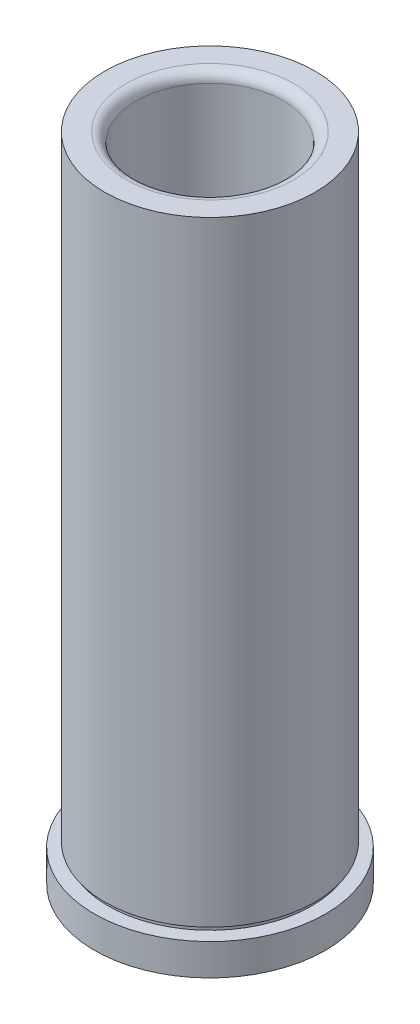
from build123d import *

# Parameters (mm, degrees)
FILLET1_R = 1.524


with BuildPart() as part:
    # Sketch1 → Revolve1 (revolve)
    with BuildSketch(Plane.XY, mode=Mode.PRIVATE) as revolve1_sk:
        with BuildLine():
            Line((-11.11885, 98.425), (-11.11885, 53.975))
            ThreePointArc((-11.11885, 53.975), (-12.016875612, 53.603025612), (-12.38885, 52.705))
            Line((-12.38885, 52.705), (-12.38885, 0.79375))
            Line((-12.38885, 0.79375), (-13.1826, 0))
            Line((-13.1826, 0), (-17.4625, 0))
            Line((-17.4625, 0), (-17.4625, 4.7625))
            Line((-17.4625, 4.7625), (-15.37335, 4.7625))
            Line((-15.37335, 4.7625), (-15.37335, 5.5245))
            Line((-15.37335, 5.5245), (-15.88135, 5.5245))
            Line((-15.88135, 5.5245), (-15.88135, 98.425))
            Line((-15.88135, 98.425), (-11.11885, 98.425))
        make_face()
    revolve(revolve1_sk.sketch.rotate(Axis((0, -1000, 0), (0, 1, 0)), 180), axis=Axis((0, -1000, 0), (0, 1, 0)))

    # Fillet1
    fillet1_edges = [part.edges().sort_by_distance(p)[0] for p in [
        (-11.11885, 98.425, 0),
    ]]
    fillet(fillet1_edges, radius=FILLET1_R)


solid = part.part
